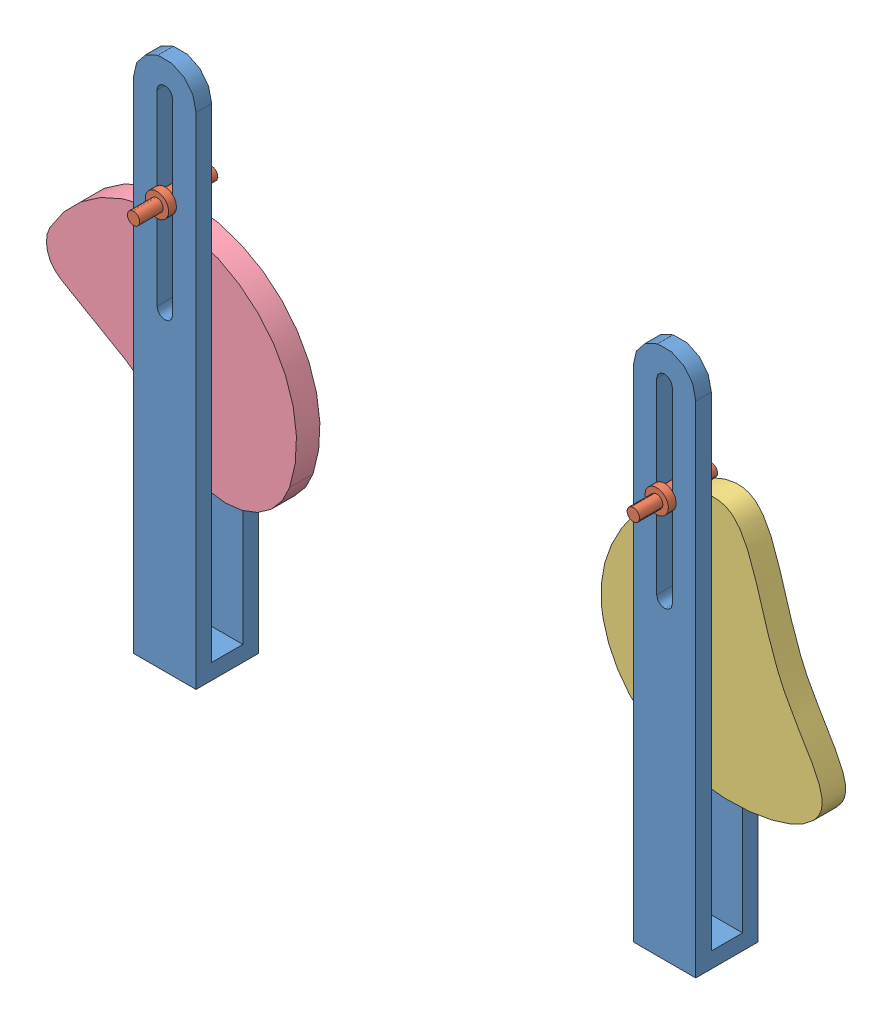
SolidWorks assembly Cam Mate.SLDASM, configuration Default (file format 3400). Lengths in mm.
Overall size (650.97 431.8 76.2).
5 component instances, 4 part files, 9 mates.
Components (placement in the parent):
- Test Frame-1: Test Frame.SLDPRT [Default] at origin size (457.2 431.8 50.8)
- Follower-1: Follower.SLDPRT [Default] at (-406.4 331.848 44.45) x (0.678589 -0.734519 0) z (0 0 1) size (19.05 19.05 63.5)
- Follower-2: Follower.SLDPRT [Default] at (0 326.3462 44.45) x (0.110257 -0.993903 0) z (0 0 1) size (19.05 19.05 63.5)
- Cam 1-1: Cam 1.SLDPRT [Default] at (0 203.2 31.75) x (-0.268953 0.963153 0) z (0 0 -1) size (214.12 166.53 19.05)
- Cam 2-1: Cam 2.SLDPRT [Default] at (-406.4 203.2 31.75) x (0.717902 -0.696144 0) z (0 0 -1) size (208.66 152.74 19.05)
Mates (geometry in assembly coordinates):
- Tangent1: tangent anti-aligned: plane of Test Frame-1 through (-412.75 406.4 -0.001) normal (1 0 0); cylinder of Follower-1
- Coincident1: coincident anti-aligned: plane of Test Frame-1 through (-406.4 406.4 38.1) normal (0 0 -1); plane of Follower-1 through (-401.7358 336.157 38.1) normal (0 0 1)
- Tangent2: tangent anti-aligned: plane of Test Frame-1 through (-6.35 406.4 -0.001) normal (1 0 0); cylinder of Follower-2
- Coincident2: coincident anti-aligned: plane of Test Frame-1 through (0 406.4 50.8) normal (0 0 1); plane of Follower-2 through (6.3113 327.0463 50.8) normal (0 0 -1)
- Concentric3: concentric anti-aligned: cylinder of Test Frame-1; cylinder of Cam 1-1
- Coincident5: coincident anti-aligned: plane of Test Frame-1 through (0 203.2 12.7) normal (0 0 1); plane of Cam 1-1 through (0 203.2 12.7) normal (0 0 -1)
- Concentric5: concentric anti-aligned: cylinder of Test Frame-1; cylinder of Cam 2-1
- Coincident7: coincident anti-aligned: plane of Test Frame-1 through (-406.4 203.2 12.7) normal (0 0 1); plane of Cam 2-1 through (-406.4 203.2 12.7) normal (0 0 -1)
- Tangent4: tangent: cylinder of Follower-2; face of Cam 1-1
